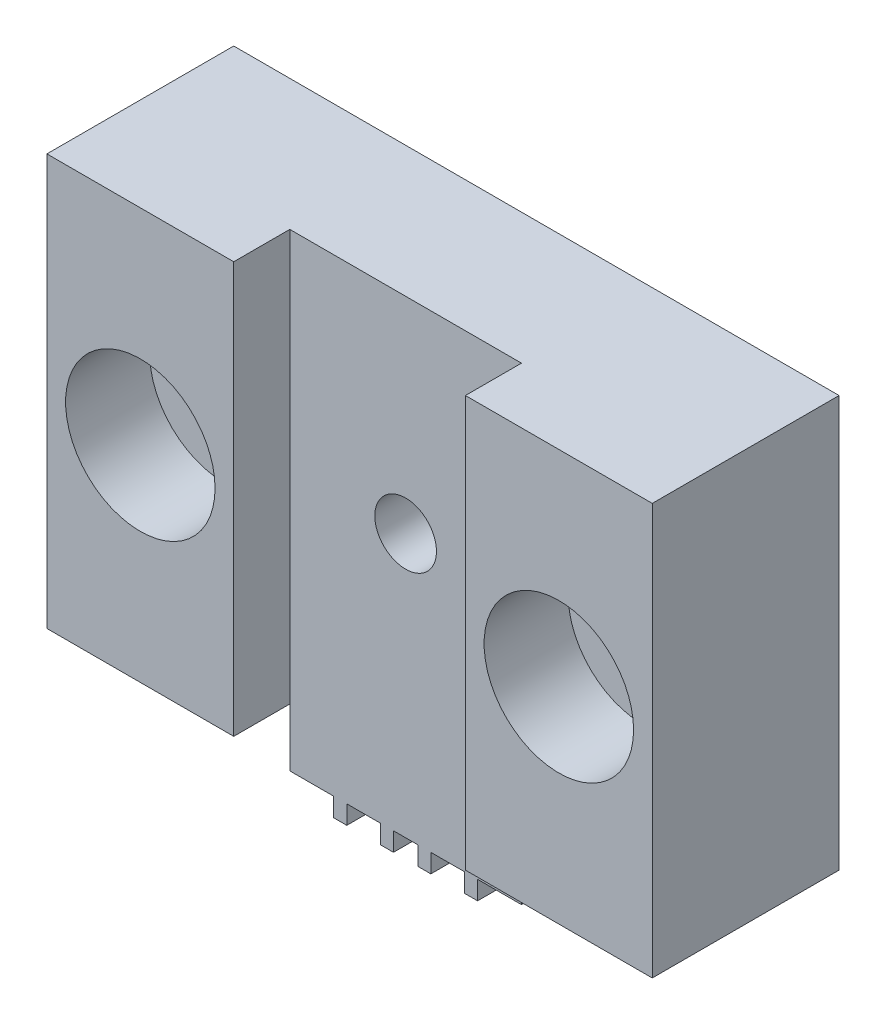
from build123d import *

# Parameters (mm, degrees)
EXTRUDE_1_DEPTH     = 10
SKETCH_2_R          = 1.65
SKETCH_2_R_2        = 2.25
CUT_EXTRUDE_1_DEPTH = 10
SKETCH_3_R          = 4
CUT_EXTRUDE_2_DEPTH = 4.5
SKETCH_4_OUTSIDE_W  = 20.558
SKETCH_4_OUTSIDE_H  = 36.658
CUT_EXTRUDE_3_DEPTH = 43.789835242
SKETCH_5_OUTSIDE_W  = 42.958
SKETCH_5_OUTSIDE_H  = 20.558
CUT_EXTRUDE_4_DEPTH = 43.789835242


with BuildPart() as part:
    # Sketch 1 → Extrude 1 (new body)
    with BuildSketch(Plane.XY):
        Polygon((10, 1), (10, 4.1), (0, 4.1), (0, 26.1), (32.4, 26.1), (32.4, 4.1), (22.4, 4.1), (22.4, 1), (20.05, 1), (20.05, 0), (19.35, 0), (19.35, 1), (17.55, 1), (17.55, 0), (16.85, 0), (16.85, 1), (15.55, 1), (15.55, 0), (14.85, 0), (14.85, 1), (13.05, 1), (13.05, 0), (12.35, 0), (12.35, 1), align=None)
    extrude(amount=EXTRUDE_1_DEPTH)

    # Sketch 2 → Cut-Extrude 1 (cut)
    with BuildSketch(Plane.XY.offset(10)):
        with Locations((16.2, 15.1)):
            Circle(SKETCH_2_R)
        with Locations((27.4, 15.1)):
            Circle(SKETCH_2_R_2)
        with Locations((5, 15.1)):
            Circle(SKETCH_2_R_2)
    extrude(amount=-CUT_EXTRUDE_1_DEPTH, mode=Mode.SUBTRACT)

    # Sketch 3 → Cut-Extrude 2 (cut)
    with BuildSketch(Plane.XY.offset(10)):
        with Locations((27.4, 15.1)):
            Circle(SKETCH_3_R)
        with Locations((5, 15.1)):
            Circle(SKETCH_3_R)
    extrude(amount=-CUT_EXTRUDE_2_DEPTH, mode=Mode.SUBTRACT)

    # Sketch 4 outside → Cut-Extrude 3 (cut, through all)
    with BuildSketch(Plane(origin=(32.4, 0, 0), x_dir=(0, 0, -1), z_dir=(1, 0, 0))):
        with Locations((-5, 13.05)):
            Rectangle(SKETCH_4_OUTSIDE_W, SKETCH_4_OUTSIDE_H)
        Polygon((-7, 0), (-3.5, 0), (-3.5, 4.1), (0, 4.1), (0, 26.1), (-10, 26.1), (-10, 4.1), (-7, 4.1), align=None, mode=Mode.SUBTRACT)
    extrude(amount=-CUT_EXTRUDE_3_DEPTH, mode=Mode.SUBTRACT)

    # Sketch 5 outside → Cut-Extrude 4 (cut, through all)
    with BuildSketch(Plane(origin=(0, 26.1, 0), x_dir=(1, 0, 0), z_dir=(0, 1, 0))):
        with Locations((16.2, -5)):
            Rectangle(SKETCH_5_OUTSIDE_W, SKETCH_5_OUTSIDE_H)
        Polygon((10, -10), (10, -7), (22.4, -7), (22.4, -10), (32.4, -10), (32.4, 0), (0, 0), (0, -10), align=None, mode=Mode.SUBTRACT)
    extrude(amount=-CUT_EXTRUDE_4_DEPTH, mode=Mode.SUBTRACT)


solid = part.part
